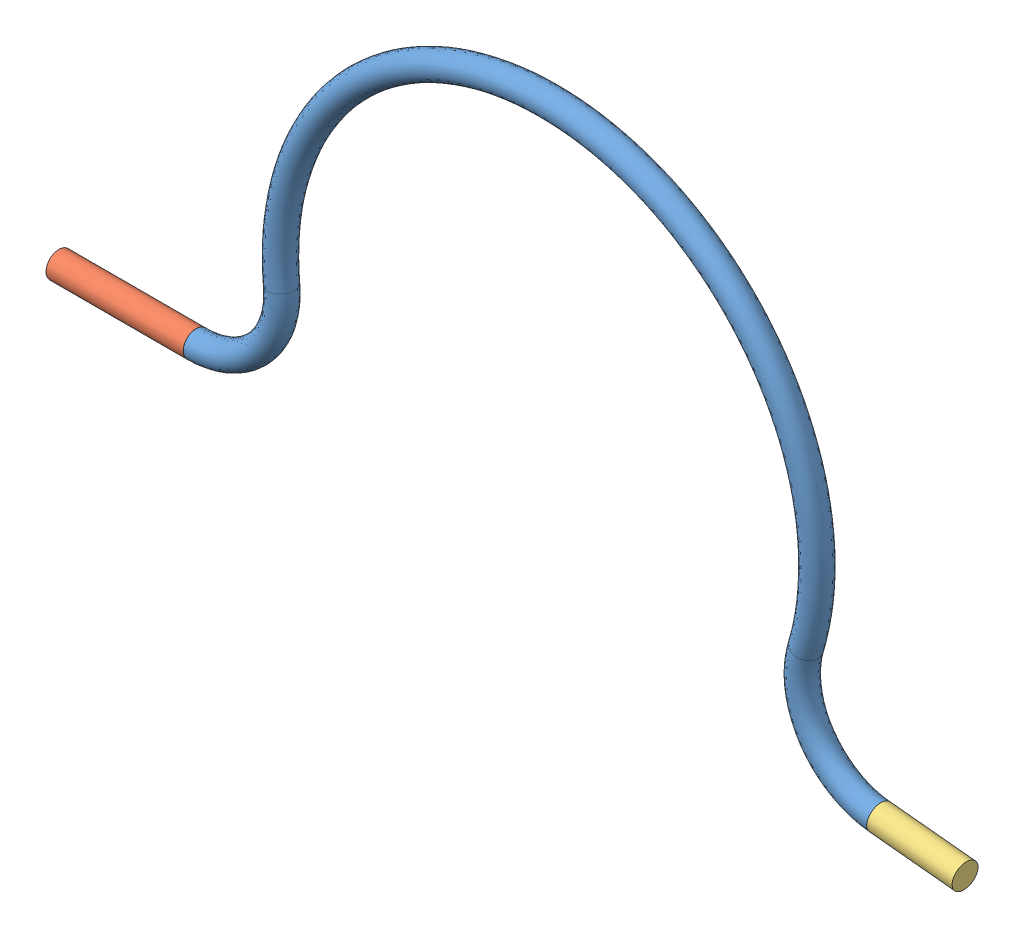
SolidWorks assembly FLEX SCHLAUCH.SLDASM, configuration Standard (file format 3400). Lengths in mm.
Overall size (1062.53 738.51 30).
3 component instances, 3 part files, 8 mates.
Components (placement in the parent):
- FLEX-SCHLAUCH-1: FLEX-SCHLAUCH.SLDPRT [Standard] at (0 100 0) size (797.55 559.15 30)
- AP 1-1: AP 1.SLDPRT [Standard] at origin size (159.8 30 30)
- AP 2-1: AP 2.SLDPRT [Standard] x (0.9802 0.19801 0) z (0 0 1) size (864.6 279.07 30)
Mates (geometry in assembly coordinates):
- Platziert1: in place: plane of AP 1-1
- Deckungsgleich1: coincident aligned: plane of ?; plane of assembly
- Deckungsgleich2: coincident aligned: plane of ?; moOrthogonalPlaneRef_w of assembly
- Deckungsgleich3: coincident anti-aligned: plane of ?; moOrthogonalPlaneRef_w of assembly
- Deckungsgleich4: coincident anti-aligned: plane of FLEX-SCHLAUCH-1 through (0 0 0) normal (-1 0 0); plane of AP 1-1 through (0 0 0) normal (1 0 0)
- Deckungsgleich5: coincident aligned: circle of FLEX-SCHLAUCH-1; circle of AP 1-1
- Deckungsgleich9: coincident: point of AP 2-1
- Deckungsgleich10: coincident aligned: unknown of AP 2-1
